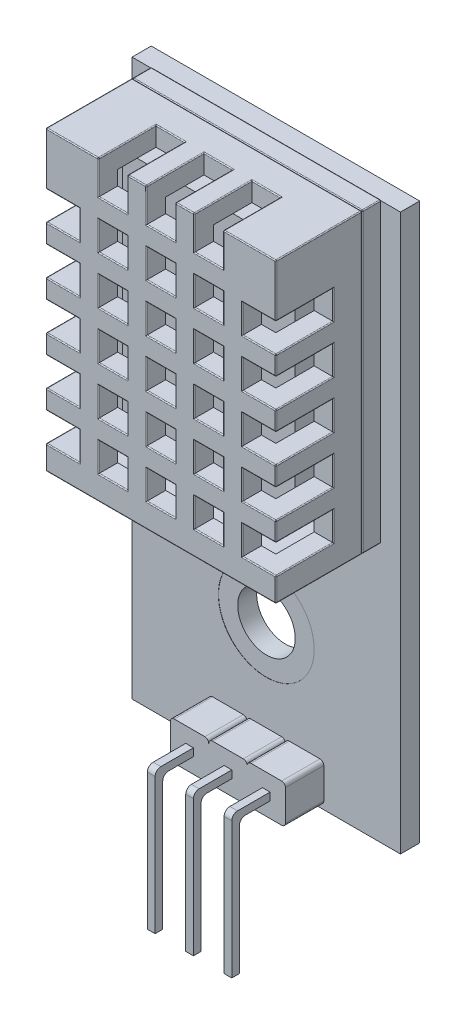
from build123d import *

# Parameters (mm, degrees)
SKETCH1_W           = 12
SKETCH1_H           = 15.5
BOSS_EXTRUDE1_DEPTH = 5.5
SHELL2_T            = -1
SKETCH3_W           = 1.5
SKETCH3_H           = 1.75
CUT_EXTRUDE1_DEPTH  = 3
SKETCH4_W           = 1.5
SKETCH4_H           = 1.5
CUT_EXTRUDE2_DEPTH  = 3
SKETCH5_W           = 1.75
SKETCH5_H           = 1.5
CUT_EXTRUDE3_DEPTH  = 3
SKETCH6_W           = 12
SKETCH6_H           = 15.5
SKETCH6_W_2         = 10
SKETCH6_H_2         = 13.5
CUT_EXTRUDE4_DEPTH  = 1
SKETCH8_W           = 12
SKETCH8_H           = 15.5
BOSS_EXTRUDE3_DEPTH = 0.99
FILLET1_R           = 0.05
FILLET2_R           = 0.05
SKETCH10_W          = 9
SKETCH10_H          = 12.5
BOSS_EXTRUDE4_DEPTH = 2
SKETCH11_W          = 14
SKETCH11_H          = 29
BOSS_EXTRUDE5_DEPTH = 1
BOSS_EXTRUDE6_DEPTH = 2
SKETCH13_W          = 0.4
SKETCH13_H          = 0.39878694
BOSS_EXTRUDE7_DEPTH = 2
SKETCH14_W          = 0.4
SKETCH14_H          = 0.400273
BOSS_EXTRUDE8_DEPTH = 7
FILLET3_R           = 0.3
FILLET4_R           = 0.3
FILLET5_R           = 0.3
FILLET6_R           = 0.3
FILLET7_R           = 0.3
FILLET8_R           = 0.3
SKETCH15_R          = 1.5
CUT_EXTRUDE5_DEPTH  = 25.112834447
SKETCH16_R          = 2.5
CUT_EXTRUDE6_DEPTH  = 0.01


with BuildPart() as part:
    # Sketch1 → Boss-Extrude1 (new body)
    with BuildSketch(Plane.XY):
        with Locations((6, 7.75)):
            Rectangle(SKETCH1_W, SKETCH1_H)
    extrude(amount=BOSS_EXTRUDE1_DEPTH)

    # Shell2
    shell2_openings = [part.faces().sort_by_distance(p)[0] for p in [
        (6, 7.75, 0),
    ]]
    offset(amount=SHELL2_T, openings=shell2_openings, kind=Kind.INTERSECTION)

    # Sketch3 → Cut-Extrude1 (cut)
    with BuildSketch(Plane.XY.offset(5.5)):
        with Locations((3.5, 14.625)):
            Rectangle(SKETCH3_W, SKETCH3_H)
        with Locations((6, 14.625)):
            Rectangle(SKETCH3_W, SKETCH3_H)
        with Locations((8.5, 14.625)):
            Rectangle(SKETCH3_W, SKETCH3_H)
    extrude(amount=-CUT_EXTRUDE1_DEPTH, mode=Mode.SUBTRACT)

    # Sketch4 → Cut-Extrude2 (cut)
    with BuildSketch(Plane.XY.offset(5.5)):
        with Locations((3.5, 12)):
            Rectangle(SKETCH4_W, SKETCH4_H)
        with Locations((6, 12)):
            Rectangle(SKETCH4_W, SKETCH4_H)
        with Locations((8.5, 12)):
            Rectangle(SKETCH4_W, SKETCH4_H)
        with Locations((6, 9.5)):
            Rectangle(SKETCH4_W, SKETCH4_H)
        with Locations((8.5, 9.5)):
            Rectangle(SKETCH4_W, SKETCH4_H)
        with Locations((6, 7)):
            Rectangle(SKETCH4_W, SKETCH4_H)
        with Locations((8.5, 7)):
            Rectangle(SKETCH4_W, SKETCH4_H)
        with Locations((6, 4.5)):
            Rectangle(SKETCH4_W, SKETCH4_H)
        with Locations((8.5, 4.5)):
            Rectangle(SKETCH4_W, SKETCH4_H)
        with Locations((6, 2)):
            Rectangle(SKETCH4_W, SKETCH4_H)
        with Locations((8.5, 2)):
            Rectangle(SKETCH4_W, SKETCH4_H)
        with Locations((3.5, 9.5)):
            Rectangle(SKETCH4_W, SKETCH4_H)
        with Locations((3.5, 7)):
            Rectangle(SKETCH4_W, SKETCH4_H)
        with Locations((3.5, 4.5)):
            Rectangle(SKETCH4_W, SKETCH4_H)
        with Locations((3.5, 2)):
            Rectangle(SKETCH4_W, SKETCH4_H)
    extrude(amount=-CUT_EXTRUDE2_DEPTH, mode=Mode.SUBTRACT)

    # Sketch5 → Cut-Extrude3 (cut)
    with BuildSketch(Plane.XY.offset(5.5)):
        with Locations((0.875, 12)):
            Rectangle(SKETCH5_W, SKETCH5_H)
        with Locations((11.125, 12)):
            Rectangle(SKETCH5_W, SKETCH5_H)
        with Locations((11.125, 9.5)):
            Rectangle(SKETCH5_W, SKETCH5_H)
        with Locations((11.125, 7)):
            Rectangle(SKETCH5_W, SKETCH5_H)
        with Locations((11.125, 4.5)):
            Rectangle(SKETCH5_W, SKETCH5_H)
        with Locations((11.125, 2)):
            Rectangle(SKETCH5_W, SKETCH5_H)
        with Locations((0.875, 9.5)):
            Rectangle(SKETCH5_W, SKETCH5_H)
        with Locations((0.875, 7)):
            Rectangle(SKETCH5_W, SKETCH5_H)
        with Locations((0.875, 4.5)):
            Rectangle(SKETCH5_W, SKETCH5_H)
        with Locations((0.875, 2)):
            Rectangle(SKETCH5_W, SKETCH5_H)
    extrude(amount=-CUT_EXTRUDE3_DEPTH, mode=Mode.SUBTRACT)

    # Sketch6 → Cut-Extrude4 (cut)
    with BuildSketch(Plane(origin=(0, 0, 0), x_dir=(-1, 0, 0), z_dir=(0, 0, -1))):
        with Locations((-6, 7.75)):
            Rectangle(SKETCH6_W, SKETCH6_H)
        with Locations((-6, 7.75)):
            Rectangle(SKETCH6_W_2, SKETCH6_H_2, mode=Mode.SUBTRACT)
    extrude(amount=-CUT_EXTRUDE4_DEPTH, mode=Mode.SUBTRACT)

    # Fillet1
    fillet1_edges = [part.edges().sort_by_distance(p)[0] for p in [
        (12, 0.625, 5.5),
        (5.25, 12, 5.5),
        (6, 11.25, 5.5),
        (6.75, 12, 5.5),
        (6, 12.75, 5.5),
        (10.625, 15.5, 5.5),
        (7.75, 12, 5.5),
        (8.5, 11.25, 5.5),
        (9.25, 12, 5.5),
        (8.5, 12.75, 5.5),
        (5.25, 9.5, 5.5),
        (6, 8.75, 5.5),
        (6.75, 9.5, 5.5),
        (6, 10.25, 5.5),
        (7.75, 9.5, 5.5),
        (8.5, 8.75, 5.5),
        (9.25, 9.5, 5.5),
        (8.5, 10.25, 5.5),
        (5.25, 7, 5.5),
        (6, 6.25, 5.5),
        (6.75, 7, 5.5),
        (6, 7.75, 5.5),
        (7.75, 7, 5.5),
        (8.5, 6.25, 5.5),
        (9.25, 7, 5.5),
        (8.5, 7.75, 5.5),
        (5.25, 4.5, 5.5),
        (6, 3.75, 5.5),
        (6.75, 4.5, 5.5),
        (6, 5.25, 5.5),
        (7.75, 4.5, 5.5),
        (8.5, 3.75, 5.5),
        (9.25, 4.5, 5.5),
        (8.5, 5.25, 5.5),
        (5.25, 2, 5.5),
        (6, 1.25, 5.5),
        (6.75, 2, 5.5),
        (6, 2.75, 5.5),
        (7.75, 2, 5.5),
        (8.5, 1.25, 5.5),
        (9.25, 2, 5.5),
        (8.5, 2.75, 5.5),
        (2.75, 9.5, 5.5),
        (3.5, 8.75, 5.5),
        (4.25, 9.5, 5.5),
        (3.5, 10.25, 5.5),
        (1.375, 15.5, 5.5),
        (2.75, 7, 5.5),
        (3.5, 6.25, 5.5),
        (4.25, 7, 5.5),
        (3.5, 7.75, 5.5),
        (2.75, 4.5, 5.5),
        (3.5, 3.75, 5.5),
        (4.25, 4.5, 5.5),
        (3.5, 5.25, 5.5),
        (2.75, 2, 5.5),
        (3.5, 1.25, 5.5),
        (4.25, 2, 5.5),
        (3.5, 2.75, 5.5),
        (3.5, 15.5, 2.5),
        (2.75, 15.5, 4),
        (4.25, 15.5, 4),
        (2.75, 14.625, 5.5),
        (3.5, 13.75, 5.5),
        (4.25, 14.625, 5.5),
        (0, 10.75, 5.5),
        (0, 12, 2.5),
        (0, 11.25, 4),
        (0, 12.75, 4),
        (0.875, 11.25, 5.5),
        (1.75, 12, 5.5),
        (0.875, 12.75, 5.5),
        (12, 14.125, 5.5),
        (12, 12, 2.5),
        (12, 12.75, 4),
        (12, 11.25, 4),
        (10.25, 12, 5.5),
        (11.125, 11.25, 5.5),
        (11.125, 12.75, 5.5),
        (12, 10.75, 5.5),
        (0, 14.125, 5.5),
        (12, 9.5, 2.5),
        (12, 10.25, 4),
        (12, 8.75, 4),
        (10.25, 9.5, 5.5),
        (11.125, 8.75, 5.5),
        (11.125, 10.25, 5.5),
        (12, 8.25, 5.5),
        (12, 7, 2.5),
        (12, 7.75, 4),
        (12, 6.25, 4),
        (10.25, 7, 5.5),
        (11.125, 6.25, 5.5),
        (11.125, 7.75, 5.5),
        (12, 5.75, 5.5),
        (12, 4.5, 2.5),
        (12, 5.25, 4),
        (12, 3.75, 4),
        (10.25, 4.5, 5.5),
        (11.125, 3.75, 5.5),
        (11.125, 5.25, 5.5),
        (12, 3.25, 5.5),
        (12, 2, 2.5),
        (12, 2.75, 4),
        (12, 1.25, 4),
        (10.25, 2, 5.5),
        (11.125, 1.25, 5.5),
        (11.125, 2.75, 5.5),
        (0, 8.25, 5.5),
        (0, 9.5, 2.5),
        (0, 8.75, 4),
        (0, 10.25, 4),
        (0.875, 8.75, 5.5),
        (1.75, 9.5, 5.5),
        (0.875, 10.25, 5.5),
        (4.75, 15.5, 5.5),
        (0, 5.75, 5.5),
        (0, 7, 2.5),
        (0, 6.25, 4),
        (0, 7.75, 4),
        (0.875, 6.25, 5.5),
        (1.75, 7, 5.5),
        (0.875, 7.75, 5.5),
        (0, 3.25, 5.5),
        (0, 4.5, 2.5),
        (0, 3.75, 4),
        (0, 5.25, 4),
        (0.875, 3.75, 5.5),
        (1.75, 4.5, 5.5),
        (0.875, 5.25, 5.5),
        (0, 0.625, 5.5),
        (6, 15.5, 2.5),
        (0, 2, 2.5),
        (0, 1.25, 4),
        (0, 2.75, 4),
        (0.875, 1.25, 5.5),
        (1.75, 2, 5.5),
        (0.875, 2.75, 5.5),
        (5.25, 15.5, 4),
        (6.75, 15.5, 4),
        (5.25, 14.625, 5.5),
        (6, 13.75, 5.5),
        (6.75, 14.625, 5.5),
        (6, 0, 1),
        (12, 7.75, 1),
        (6, 15.5, 1),
        (0, 7.75, 1),
        (7.25, 15.5, 5.5),
        (6, 0, 5.5),
        (8.5, 15.5, 2.5),
        (0, 15.5, 3.25),
        (7.75, 15.5, 4),
        (9.25, 15.5, 4),
        (7.75, 14.625, 5.5),
        (12, 15.5, 3.25),
        (8.5, 13.75, 5.5),
        (9.25, 14.625, 5.5),
        (12, 0, 3.25),
        (0, 0, 3.25),
        (2.75, 12, 5.5),
        (3.5, 11.25, 5.5),
        (4.25, 12, 5.5),
        (3.5, 12.75, 5.5),
    ]]
    fillet(fillet1_edges, radius=FILLET1_R)


with BuildPart() as body_2:
    # Sketch8 → Boss-Extrude3 (new body)
    with BuildSketch(Plane.XY.offset(0.99)):
        with Locations((6, 7.75)):
            Rectangle(SKETCH8_W, SKETCH8_H)
    extrude(amount=-BOSS_EXTRUDE3_DEPTH)

    # Fillet2
    fillet2_edges = [body_2.edges().sort_by_distance(p)[0] for p in [
        (0, 7.75, 0),
        (6, 0, 0),
        (12, 7.75, 0),
        (6, 0, 0.99),
        (0, 7.75, 0.99),
        (6, 15.5, 0.99),
        (12, 7.75, 0.99),
        (6, 15.5, 0),
        (12, 0, 0.495),
        (0, 0, 0.495),
        (0, 15.5, 0.495),
        (12, 15.5, 0.495),
    ]]
    fillet(fillet2_edges, radius=FILLET2_R)

    # Sketch10 → Boss-Extrude4 (add)
    with BuildSketch(Plane.XY.offset(0.99)):
        with Locations((6, 7.75)):
            Rectangle(SKETCH10_W, SKETCH10_H)
    extrude(amount=BOSS_EXTRUDE4_DEPTH)

    # Sketch11 → Boss-Extrude5 (add)
    with BuildSketch(Plane(origin=(0, 0, 0), x_dir=(-1, 0, 0), z_dir=(0, 0, -1))):
        with Locations((-6, 0.95)):
            Rectangle(SKETCH11_W, SKETCH11_H)
    extrude(amount=BOSS_EXTRUDE5_DEPTH)

    # Sketch12 → Boss-Extrude6 (add)
    with BuildSketch(Plane.XY):
        with BuildLine():
            Line((4.8, -13.35), (3.2, -13.35))
            ThreePointArc((3.2, -13.35), (3.058578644, -13.291421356), (3, -13.15))
            Line((3, -13.15), (3, -11.55))
            ThreePointArc((3, -11.55), (3.058578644, -11.408578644), (3.2, -11.35))
            Line((3.2, -11.35), (4.8, -11.35))
            ThreePointArc((4.8, -11.35), (4.941421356, -11.408578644), (5, -11.55))
            Line((5, -11.55), (5, -13.15))
            ThreePointArc((5, -13.15), (4.941421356, -13.291421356), (4.8, -13.35))
        make_face()
        with BuildLine():
            Line((7, -11.55), (7, -13.15))
            ThreePointArc((7, -13.15), (6.941421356, -13.291421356), (6.8, -13.35))
            Line((6.8, -13.35), (5.2, -13.35))
            ThreePointArc((5.2, -13.35), (5.058578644, -13.291421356), (5, -13.15))
            Line((5, -13.15), (5, -11.55))
            ThreePointArc((5, -11.55), (5.058578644, -11.408578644), (5.2, -11.35))
            Line((5.2, -11.35), (6.8, -11.35))
            ThreePointArc((6.8, -11.35), (6.941421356, -11.408578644), (7, -11.55))
        make_face()
        with BuildLine():
            ThreePointArc((9, -13.15), (8.941421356, -13.291421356), (8.8, -13.35))
            Line((8.8, -13.35), (7.2, -13.35))
            ThreePointArc((7.2, -13.35), (7.058578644, -13.291421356), (7, -13.15))
            Line((7, -13.15), (7, -11.55))
            ThreePointArc((7, -11.55), (7.058578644, -11.408578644), (7.2, -11.35))
            Line((7.2, -11.35), (8.8, -11.35))
            ThreePointArc((8.8, -11.35), (8.941421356, -11.408578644), (9, -11.55))
            Line((9, -11.55), (9, -13.15))
        make_face()
    extrude(amount=BOSS_EXTRUDE6_DEPTH)

    # Sketch13 → Boss-Extrude7 (add)
    with BuildSketch(Plane.XY.offset(2)):
        with Locations((4, -12.35)):
            Rectangle(SKETCH13_W, SKETCH13_H)
        with Locations((6, -12.35)):
            Rectangle(SKETCH13_W, SKETCH13_H)
        with Locations((8, -12.35)):
            Rectangle(SKETCH13_W, SKETCH13_H)
    extrude(amount=BOSS_EXTRUDE7_DEPTH)

    # Sketch14 → Boss-Extrude8 (add)
    with BuildSketch(Plane.XZ.offset(12.54939347)):
        with Locations((6, 3.7998635)):
            Rectangle(SKETCH14_W, SKETCH14_H)
        with Locations((4, 3.7998635)):
            Rectangle(SKETCH14_W, SKETCH14_H)
        with Locations((8, 3.7998635)):
            Rectangle(SKETCH14_W, SKETCH14_H)
    extrude(amount=BOSS_EXTRUDE8_DEPTH)

    # Fillet3
    fillet3_edges = [body_2.edges().sort_by_distance(p)[0] for p in [
        (4, -12.54939347, 3.599727),
    ]]
    fillet(fillet3_edges, radius=FILLET3_R)

    # Fillet4
    fillet4_edges = [body_2.edges().sort_by_distance(p)[0] for p in [
        (6, -12.54939347, 3.599727),
    ]]
    fillet(fillet4_edges, radius=FILLET4_R)

    # Fillet5
    fillet5_edges = [body_2.edges().sort_by_distance(p)[0] for p in [
        (8, -12.54939347, 3.599727),
    ]]
    fillet(fillet5_edges, radius=FILLET5_R)

    # Fillet6
    fillet6_edges = [body_2.edges().sort_by_distance(p)[0] for p in [
        (4, -12.15060653, 4),
    ]]
    fillet(fillet6_edges, radius=FILLET6_R)

    # Fillet7
    fillet7_edges = [body_2.edges().sort_by_distance(p)[0] for p in [
        (6, -12.15060653, 4),
    ]]
    fillet(fillet7_edges, radius=FILLET7_R)

    # Fillet8
    fillet8_edges = [body_2.edges().sort_by_distance(p)[0] for p in [
        (8, -12.15060653, 4),
    ]]
    fillet(fillet8_edges, radius=FILLET8_R)

    # Sketch15 → Cut-Extrude5 (cut, through all)
    with BuildSketch(Plane.XY):
        with Locations((6, -6.566844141)):
            Circle(SKETCH15_R)
    extrude(amount=-CUT_EXTRUDE5_DEPTH, mode=Mode.SUBTRACT)

    # Sketch16 → Cut-Extrude6 (cut)
    with BuildSketch(Plane.XY):
        with Locations((6, -6.566844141)):
            Circle(SKETCH16_R)
    extrude(amount=-CUT_EXTRUDE6_DEPTH, mode=Mode.SUBTRACT)


solid = Compound([part.part, body_2.part])
